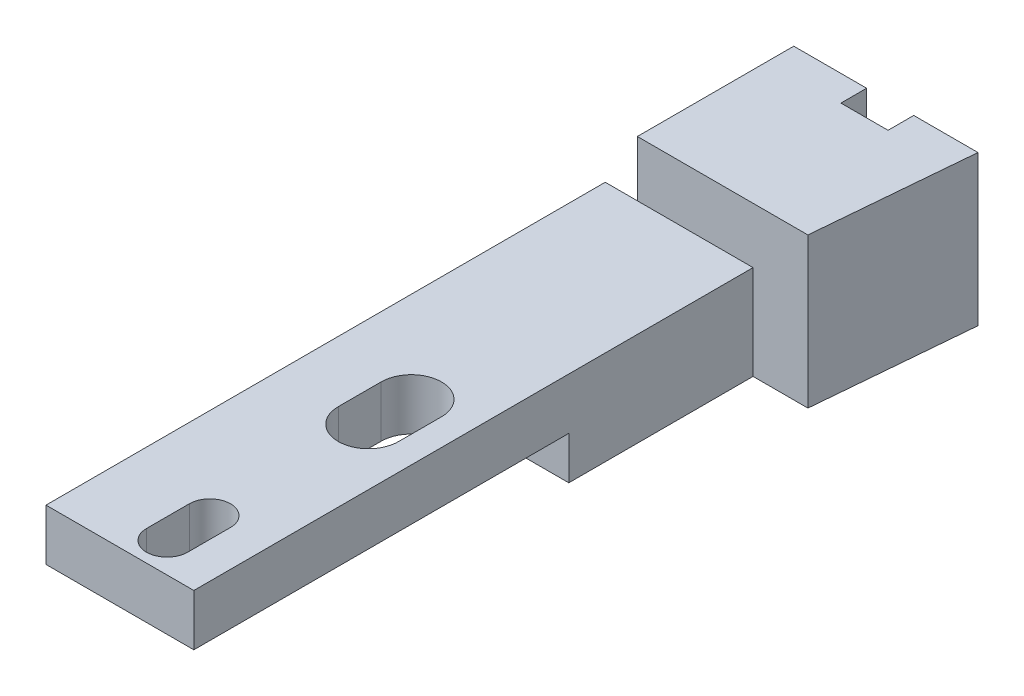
from build123d import *

# Parameters (mm, degrees)
SKETCH1_W                            = 11.43
SKETCH1_H                            = 8.89
EXTRUDE1_DEPTH                       = 33.02
SKETCH3_W                            = 2.54
SKETCH3_H                            = 23.749
CUT_EXTRUDE1_DEPTH                   = 35.734906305
SKETCH4_W                            = 8.89
SKETCH4_H                            = 23.749
CUT_EXTRUDE2_DEPTH                   = 2.54
SKETCH5_W                            = 1.905
SKETCH5_H                            = 23.749
CUT_EXTRUDE3_DEPTH                   = 35.17314905
CUT_EXTRUDE5_DEPTH                   = 40.920041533
F_1_16_0_062500_DIAMETER_HOLE1_D     = 1.5875
F_1_16_0_062500_DIAMETER_HOLE1_DEPTH = 4.318
F_1_16_0_062500_DIAMETER_HOLE1_TIP   = 0.476933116
F_2_56_TAPPED_HOLE1_D                = 1.778
F_2_56_TAPPED_HOLE1_DEPTH            = 5.73278
SKETCH12_W                           = 2.794
SKETCH12_H                           = 8.89
CUT_EXTRUDE6_DEPTH                   = 1.524
SKETCH15_W                           = 23.749
SKETCH15_H                           = 6.35
EXTRUDE5_DEPTH                       = 3.175
SKETCH6_R                            = 1.7907
CUT_EXTRUDE4_DEPTH                   = 35.879712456
SKETCH16_W                           = 10.16
SKETCH16_H                           = 6.35
EXTRUDE6_DEPTH                       = 9.398
F_41_0_096_DIAMETER_HOLE1_D          = 2.4384
SKETCH19_W                           = 10.16
SKETCH19_H                           = 33.147
CUT_EXTRUDE7_DEPTH                   = 0.762
CUT_EXTRUDE8_DEPTH                   = 45.32008873
CUT_EXTRUDE9_DEPTH                   = 1.143
SKETCH22_W                           = 33.147
SKETCH22_H                           = 5.588
CUT_EXTRUDE10_DEPTH                  = 0.127
SKETCH23_W                           = 33.147
SKETCH23_H                           = 5.588
CUT_EXTRUDE11_DEPTH                  = 1.27
SKETCH24_W                           = 22.225
SKETCH24_H                           = 2.54
CUT_EXTRUDE12_DEPTH                  = 49.396332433
CUT_EXTRUDE13_DEPTH                  = 44.52618142


with BuildPart() as part:
    # Sketch1 → Extrude1 (new body)
    with BuildSketch(Plane.XY):
        with Locations((-0.381, 17.145)):
            Rectangle(SKETCH1_W, SKETCH1_H)
    extrude(amount=EXTRUDE1_DEPTH)

    # Sketch3 → Cut-Extrude1 (cut, through all)
    with BuildSketch(Plane(origin=(0, 21.59, 0), x_dir=(-1, 0, 0), z_dir=(0, 1, 0))):
        with Locations((-4.064, 21.1455)):
            Rectangle(SKETCH3_W, SKETCH3_H)
    extrude(amount=-CUT_EXTRUDE1_DEPTH, mode=Mode.SUBTRACT)

    # Sketch4 → Cut-Extrude2 (cut)
    with BuildSketch(Plane(origin=(0, 21.59, 0), x_dir=(-1, 0, 0), z_dir=(0, 1, 0))):
        with Locations((1.651, 21.1455)):
            Rectangle(SKETCH4_W, SKETCH4_H)
    extrude(amount=-CUT_EXTRUDE2_DEPTH, mode=Mode.SUBTRACT)

    # Sketch5 → Cut-Extrude3 (cut, through all)
    with BuildSketch(Plane(origin=(0, 19.05, 0), x_dir=(-1, 0, 0), z_dir=(0, 1, 0))):
        with Locations((-1.8415, 21.1455)):
            Rectangle(SKETCH5_W, SKETCH5_H)
    extrude(amount=-CUT_EXTRUDE3_DEPTH, mode=Mode.SUBTRACT)

    # Sketch7 → Cut-Extrude5 (cut, through all)
    with BuildSketch(Plane(origin=(0, 0, 0), x_dir=(1, 0, 0), z_dir=(0, 1, 0))):
        Polygon((5.334, 0), (4.5228926, -9.271), (5.334, -9.271), align=None)
    extrude(amount=CUT_EXTRUDE5_DEPTH, mode=Mode.SUBTRACT)

    # 1_16 _0.062500_ Diameter Hole1
    with Locations(Plane(origin=(0, 0, 0), x_dir=(-1, 0, 0), z_dir=(0, 0, -1))):
        with Locations((-2.794, 19.05), (3.556, 15.24)):
            Hole(F_1_16_0_062500_DIAMETER_HOLE1_D / 2, depth=F_1_16_0_062500_DIAMETER_HOLE1_DEPTH)
            with Locations((0, 0, -(F_1_16_0_062500_DIAMETER_HOLE1_DEPTH + F_1_16_0_062500_DIAMETER_HOLE1_TIP / 2))):  # 118° drill point
                Cone(0, F_1_16_0_062500_DIAMETER_HOLE1_D / 2, F_1_16_0_062500_DIAMETER_HOLE1_TIP, mode=Mode.SUBTRACT)

    # 2-56 Tapped Hole1
    with Locations(Plane(origin=(0, 0, 0), x_dir=(-1, 0, 0), z_dir=(0, 0, -1))):
        with Locations((-2.794, 15.24), (3.556, 19.05)):
            Hole(F_2_56_TAPPED_HOLE1_D / 2, depth=F_2_56_TAPPED_HOLE1_DEPTH)

    # Sketch12 → Cut-Extrude6 (cut)
    with BuildSketch(Plane(origin=(0, 0, 0), x_dir=(-1, 0, 0), z_dir=(0, 0, -1))):
        with Locations((0.381, 17.145)):
            Rectangle(SKETCH12_W, SKETCH12_H)
    extrude(amount=-CUT_EXTRUDE6_DEPTH, mode=Mode.SUBTRACT)

    # Sketch15 → Extrude5 (add)
    with BuildSketch(Plane.ZY.offset(6.096)):
        with Locations((21.1455, 15.875)):
            Rectangle(SKETCH15_W, SKETCH15_H)
    extrude(amount=EXTRUDE5_DEPTH)

    # Sketch6 → Cut-Extrude4 (cut, through all)
    with BuildSketch(Plane(origin=(0, 19.05, 0), x_dir=(-1, 0, 0), z_dir=(0, 1, 0))):
        with Locations(Location((2.6035, 27.432, 0), (0, 0, 90))):
            Circle(SKETCH6_R)
    extrude(amount=-CUT_EXTRUDE4_DEPTH, mode=Mode.SUBTRACT)

    # Sketch16 → Extrude6 (add)
    with BuildSketch(Plane.XY.offset(33.02)):
        with Locations((-4.191, 15.875)):
            Rectangle(SKETCH16_W, SKETCH16_H)
    extrude(amount=EXTRUDE6_DEPTH)

    # 41 _0.096_ Diameter Hole1 (through all)
    with Locations(Plane(origin=(0, 19.05, 0), x_dir=(-1, 0, 0), z_dir=(0, 1, 0))):
        with Locations((2.6035, 39.37)):
            Hole(F_41_0_096_DIAMETER_HOLE1_D / 2)

    # Sketch19 → Cut-Extrude7 (cut)
    with BuildSketch(Plane(origin=(0, 19.05, 0), x_dir=(-1, 0, 0), z_dir=(0, 1, 0))):
        with Locations((4.191, 25.8445)):
            Rectangle(SKETCH19_W, SKETCH19_H)
    extrude(amount=-CUT_EXTRUDE7_DEPTH, mode=Mode.SUBTRACT)

    # Sketch20 → Cut-Extrude8 (cut, through all)
    with BuildSketch(Plane.XZ.offset(-12.7)):
        Polygon((4.5228926, 9.271), (5.334, 0), (4.824059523, 0), (4.012952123, 9.271), align=None)
    extrude(amount=-CUT_EXTRUDE8_DEPTH, mode=Mode.SUBTRACT)

    # Sketch21 → Cut-Extrude9 (cut)
    with BuildSketch(Plane.ZY.offset(6.096)):
        Polygon((0, 12.7), (3.81, 12.7), (0, 16.51), align=None)
    extrude(amount=-CUT_EXTRUDE9_DEPTH, mode=Mode.SUBTRACT)

    # Sketch22 → Cut-Extrude10 (cut)
    with BuildSketch(Plane.ZY.offset(-0.889)):
        with Locations((25.8445, 15.494)):
            Rectangle(SKETCH22_W, SKETCH22_H)
    extrude(amount=CUT_EXTRUDE10_DEPTH, mode=Mode.SUBTRACT)

    # Sketch23 → Cut-Extrude11 (cut)
    with BuildSketch(Plane.ZY.offset(9.271)):
        with Locations((25.8445, 15.494)):
            Rectangle(SKETCH23_W, SKETCH23_H)
    extrude(amount=-CUT_EXTRUDE11_DEPTH, mode=Mode.SUBTRACT)

    # Sketch24 → Cut-Extrude12 (cut, through all)
    with BuildSketch(Plane(origin=(0.762, 0, 0), x_dir=(0, 0, -1), z_dir=(1, 0, 0))):
        with Locations((-31.3055, 13.97)):
            Rectangle(SKETCH24_W, SKETCH24_H)
    extrude(amount=-CUT_EXTRUDE12_DEPTH, mode=Mode.SUBTRACT)

    # Sketch25 → Cut-Extrude13 (cut, through all)
    with BuildSketch(Plane(origin=(0, 18.288, 0), x_dir=(1, 0, 0), z_dir=(0, 1, 0))):
        with BuildLine():
            Line((-0.8128, -26.162), (-0.8128, -28.702))
            ThreePointArc((-0.8128, -28.702), (-2.6035, -30.4927), (-4.3942, -28.702))
            Line((-4.3942, -28.702), (-4.3942, -26.162))
            ThreePointArc((-4.3942, -26.162), (-2.6035, -24.3713), (-0.8128, -26.162))
        make_face()
        with BuildLine():
            Line((-1.3843, -38.1), (-1.3843, -40.64))
            ThreePointArc((-1.3843, -40.64), (-2.6035, -41.8592), (-3.8227, -40.64))
            Line((-3.8227, -40.64), (-3.8227, -38.1))
            ThreePointArc((-3.8227, -38.1), (-2.6035, -36.8808), (-1.3843, -38.1))
        make_face()
    extrude(amount=-CUT_EXTRUDE13_DEPTH, mode=Mode.SUBTRACT)


solid = part.part
